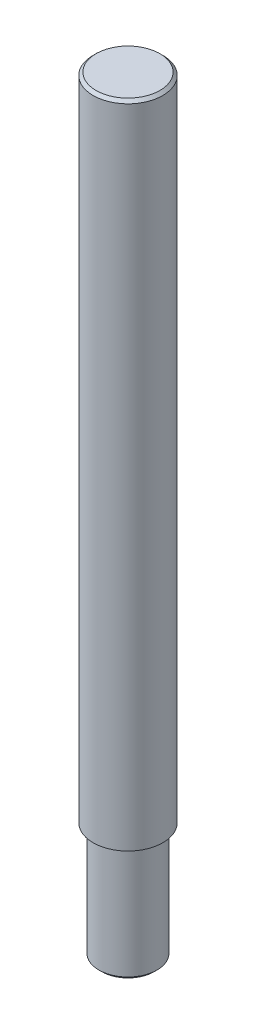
ISO-10303-21;
HEADER;
FILE_DESCRIPTION(('STEP AP214'),'2;1');
FILE_NAME('part.step','',(''),(''),'','','');
FILE_SCHEMA(('AUTOMOTIVE_DESIGN { 1 0 10303 214 1 1 1 1 }'));
ENDSEC;
DATA;
#1=APPLICATION_CONTEXT('core data for automotive mechanical design processes');
#2=APPLICATION_PROTOCOL_DEFINITION('international standard','automotive_design',2000,#1);
#3=PRODUCT_CONTEXT('',#1,'mechanical');
#4=PRODUCT('Part','Part','',(#3));
#5=PRODUCT_RELATED_PRODUCT_CATEGORY('part','',(#4));
#6=PRODUCT_DEFINITION_FORMATION('','',#4);
#7=PRODUCT_DEFINITION_CONTEXT('part definition',#1,'design');
#8=PRODUCT_DEFINITION('design','',#6,#7);
#9=PRODUCT_DEFINITION_SHAPE('','',#8);
#10=(LENGTH_UNIT() NAMED_UNIT(*) SI_UNIT(.MILLI.,.METRE.));
#11=(NAMED_UNIT(*) PLANE_ANGLE_UNIT() SI_UNIT($,.RADIAN.));
#12=(NAMED_UNIT(*) SI_UNIT($,.STERADIAN.) SOLID_ANGLE_UNIT());
#13=UNCERTAINTY_MEASURE_WITH_UNIT(LENGTH_MEASURE(1.E-05),#10,'distance_accuracy_value','');
#14=(GEOMETRIC_REPRESENTATION_CONTEXT(3) GLOBAL_UNCERTAINTY_ASSIGNED_CONTEXT((#13)) GLOBAL_UNIT_ASSIGNED_CONTEXT((#10,
#11,#12)) REPRESENTATION_CONTEXT('',''));
#15=CARTESIAN_POINT('',(0.,0.,0.));
#16=DIRECTION('',(0.,0.,1.));
#17=DIRECTION('',(1.,0.,0.));
#18=AXIS2_PLACEMENT_3D('',#15,#16,#17);
#19=CARTESIAN_POINT('',(0.,-10.,0.));
#20=DIRECTION('',(0.,1.,0.));
#21=DIRECTION('',(0.,0.,1.));
#22=AXIS2_PLACEMENT_3D('',#19,#20,#21);
#23=CYLINDRICAL_SURFACE('',#22,2.5);
#24=CARTESIAN_POINT('',(0.,-9.75,0.));
#25=DIRECTION('',(0.,1.,0.));
#26=DIRECTION('',(0.,0.,1.));
#27=AXIS2_PLACEMENT_3D('',#24,#25,#26);
#28=CIRCLE('',#27,2.5);
#29=CARTESIAN_POINT('',(0.,-9.75,2.5));
#30=VERTEX_POINT('',#29);
#31=EDGE_CURVE('E9179',#30,#30,#28,.T.);
#32=ORIENTED_EDGE('',*,*,#31,.T.);
#33=EDGE_LOOP('',(#32));
#34=FACE_BOUND('',#33,.T.);
#35=CARTESIAN_POINT('',(0.,0.,0.));
#36=DIRECTION('',(0.,1.,0.));
#37=DIRECTION('',(0.,0.,1.));
#38=AXIS2_PLACEMENT_3D('',#35,#36,#37);
#39=CIRCLE('',#38,2.5);
#40=CARTESIAN_POINT('',(0.,0.,2.5));
#41=VERTEX_POINT('',#40);
#42=EDGE_CURVE('E9192',#41,#41,#39,.T.);
#43=ORIENTED_EDGE('',*,*,#42,.F.);
#44=EDGE_LOOP('',(#43));
#45=FACE_BOUND('',#44,.T.);
#46=ADVANCED_FACE('F9173',(#34,#45),#23,.T.);
#47=CARTESIAN_POINT('',(0.,-10.,0.));
#48=DIRECTION('',(0.,1.,0.));
#49=DIRECTION('',(0.,0.,1.));
#50=AXIS2_PLACEMENT_3D('',#47,#48,#49);
#51=PLANE('',#50);
#52=CARTESIAN_POINT('',(0.,-10.,0.));
#53=DIRECTION('',(0.,1.,0.));
#54=DIRECTION('',(0.,0.,1.));
#55=AXIS2_PLACEMENT_3D('',#52,#53,#54);
#56=CIRCLE('',#55,2.25);
#57=CARTESIAN_POINT('',(0.,-10.,2.25));
#58=VERTEX_POINT('',#57);
#59=EDGE_CURVE('E10',#58,#58,#56,.F.);
#60=ORIENTED_EDGE('',*,*,#59,.T.);
#61=EDGE_LOOP('',(#60));
#62=FACE_BOUND('',#61,.T.);
#63=ADVANCED_FACE('F9218',(#62),#51,.F.);
#64=CARTESIAN_POINT('',(0.,56.,0.));
#65=DIRECTION('',(0.,-1.,0.));
#66=DIRECTION('',(0.,0.,-1.));
#67=AXIS2_PLACEMENT_3D('',#64,#65,#66);
#68=CYLINDRICAL_SURFACE('',#67,3.);
#69=CARTESIAN_POINT('',(0.,55.75,0.));
#70=DIRECTION('',(0.,1.,0.));
#71=DIRECTION('',(0.,0.,1.));
#72=AXIS2_PLACEMENT_3D('',#69,#70,#71);
#73=CIRCLE('',#72,3.);
#74=CARTESIAN_POINT('',(0.,55.75,3.));
#75=VERTEX_POINT('',#74);
#76=EDGE_CURVE('E9183',#75,#75,#73,.F.);
#77=ORIENTED_EDGE('',*,*,#76,.T.);
#78=EDGE_LOOP('',(#77));
#79=FACE_BOUND('',#78,.T.);
#80=CARTESIAN_POINT('',(0.,0.,0.));
#81=DIRECTION('',(0.,1.,0.));
#82=DIRECTION('',(0.,0.,1.));
#83=AXIS2_PLACEMENT_3D('',#80,#81,#82);
#84=CIRCLE('',#83,3.);
#85=CARTESIAN_POINT('',(0.,0.,3.));
#86=VERTEX_POINT('',#85);
#87=EDGE_CURVE('E9195',#86,#86,#84,.T.);
#88=ORIENTED_EDGE('',*,*,#87,.T.);
#89=EDGE_LOOP('',(#88));
#90=FACE_BOUND('',#89,.T.);
#91=ADVANCED_FACE('F9199',(#79,#90),#68,.T.);
#92=CARTESIAN_POINT('',(0.,56.,0.));
#93=DIRECTION('',(0.,1.,0.));
#94=DIRECTION('',(0.,0.,1.));
#95=AXIS2_PLACEMENT_3D('',#92,#93,#94);
#96=PLANE('',#95);
#97=CARTESIAN_POINT('',(0.,56.,0.));
#98=DIRECTION('',(0.,1.,0.));
#99=DIRECTION('',(0.,0.,1.));
#100=AXIS2_PLACEMENT_3D('',#97,#98,#99);
#101=CIRCLE('',#100,2.75);
#102=CARTESIAN_POINT('',(0.,56.,2.75));
#103=VERTEX_POINT('',#102);
#104=EDGE_CURVE('E9187',#103,#103,#101,.T.);
#105=ORIENTED_EDGE('',*,*,#104,.T.);
#106=EDGE_LOOP('',(#105));
#107=FACE_BOUND('',#106,.T.);
#108=ADVANCED_FACE('F9204',(#107),#96,.T.);
#109=CARTESIAN_POINT('',(0.,0.,0.));
#110=DIRECTION('',(0.,1.,0.));
#111=DIRECTION('',(0.,0.,1.));
#112=AXIS2_PLACEMENT_3D('',#109,#110,#111);
#113=PLANE('',#112);
#114=ORIENTED_EDGE('',*,*,#42,.T.);
#115=EDGE_LOOP('',(#114));
#116=FACE_BOUND('',#115,.T.);
#117=ORIENTED_EDGE('',*,*,#87,.F.);
#118=EDGE_LOOP('',(#117));
#119=FACE_BOUND('',#118,.T.);
#120=ADVANCED_FACE('F9201',(#116,#119),#113,.F.);
#121=CARTESIAN_POINT('',(0.,56.,0.));
#122=DIRECTION('',(0.,-1.,0.));
#123=DIRECTION('',(0.,0.,-1.));
#124=AXIS2_PLACEMENT_3D('',#121,#122,#123);
#125=CONICAL_SURFACE('',#124,2.75,0.785398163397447);
#126=ORIENTED_EDGE('',*,*,#76,.F.);
#127=EDGE_LOOP('',(#126));
#128=FACE_BOUND('',#127,.T.);
#129=ORIENTED_EDGE('',*,*,#104,.F.);
#130=EDGE_LOOP('',(#129));
#131=FACE_BOUND('',#130,.T.);
#132=ADVANCED_FACE('F9203',(#128,#131),#125,.T.);
#133=CARTESIAN_POINT('',(0.,-9.75,0.));
#134=DIRECTION('',(0.,1.,0.));
#135=DIRECTION('',(0.,0.,1.));
#136=AXIS2_PLACEMENT_3D('',#133,#134,#135);
#137=CONICAL_SURFACE('',#136,2.5,0.785398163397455);
#138=ORIENTED_EDGE('',*,*,#59,.F.);
#139=EDGE_LOOP('',(#138));
#140=FACE_BOUND('',#139,.T.);
#141=ORIENTED_EDGE('',*,*,#31,.F.);
#142=EDGE_LOOP('',(#141));
#143=FACE_BOUND('',#142,.T.);
#144=ADVANCED_FACE('F9211',(#140,#143),#137,.T.);
#145=CLOSED_SHELL('',(#46,#63,#91,#108,#120,#132,#144));
#146=MANIFOLD_SOLID_BREP('B2',#145);
#147=ADVANCED_BREP_SHAPE_REPRESENTATION('',(#18,#146),#14);
#148=SHAPE_DEFINITION_REPRESENTATION(#9,#147);
ENDSEC;
END-ISO-10303-21;
